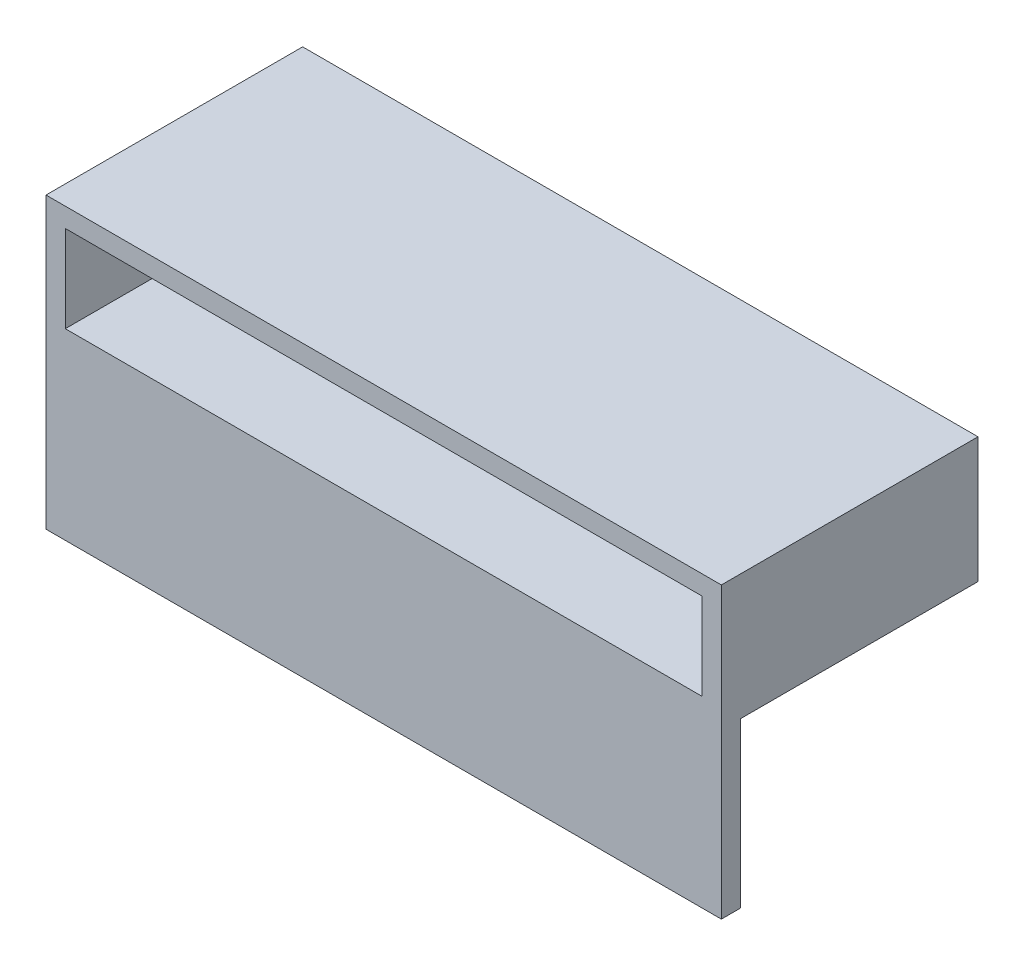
ISO-10303-21;
HEADER;
FILE_DESCRIPTION(('STEP AP214'),'2;1');
FILE_NAME('part.step','',(''),(''),'','','');
FILE_SCHEMA(('AUTOMOTIVE_DESIGN { 1 0 10303 214 1 1 1 1 }'));
ENDSEC;
DATA;
#1=APPLICATION_CONTEXT('core data for automotive mechanical design processes');
#2=APPLICATION_PROTOCOL_DEFINITION('international standard','automotive_design',2000,#1);
#3=PRODUCT_CONTEXT('',#1,'mechanical');
#4=PRODUCT('Part','Part','',(#3));
#5=PRODUCT_RELATED_PRODUCT_CATEGORY('part','',(#4));
#6=PRODUCT_DEFINITION_FORMATION('','',#4);
#7=PRODUCT_DEFINITION_CONTEXT('part definition',#1,'design');
#8=PRODUCT_DEFINITION('design','',#6,#7);
#9=PRODUCT_DEFINITION_SHAPE('','',#8);
#10=(LENGTH_UNIT() NAMED_UNIT(*) SI_UNIT(.MILLI.,.METRE.));
#11=(NAMED_UNIT(*) PLANE_ANGLE_UNIT() SI_UNIT($,.RADIAN.));
#12=(NAMED_UNIT(*) SI_UNIT($,.STERADIAN.) SOLID_ANGLE_UNIT());
#13=UNCERTAINTY_MEASURE_WITH_UNIT(LENGTH_MEASURE(1.E-05),#10,'distance_accuracy_value','');
#14=(GEOMETRIC_REPRESENTATION_CONTEXT(3) GLOBAL_UNCERTAINTY_ASSIGNED_CONTEXT((#13)) GLOBAL_UNIT_ASSIGNED_CONTEXT((#10,
#11,#12)) REPRESENTATION_CONTEXT('',''));
#15=CARTESIAN_POINT('',(0.,0.,0.));
#16=DIRECTION('',(0.,0.,1.));
#17=DIRECTION('',(1.,0.,0.));
#18=AXIS2_PLACEMENT_3D('',#15,#16,#17);
#19=CARTESIAN_POINT('',(-35.,0.,2.));
#20=DIRECTION('',(1.,0.,0.));
#21=DIRECTION('',(0.,0.,-1.));
#22=AXIS2_PLACEMENT_3D('',#19,#20,#21);
#23=PLANE('',#22);
#24=DIRECTION('',(0.,0.,-1.));
#25=VECTOR('',#24,1.);
#26=CARTESIAN_POINT('',(-35.,30.,2.));
#27=LINE('',#26,#25);
#28=CARTESIAN_POINT('',(-35.,30.,2.));
#29=VERTEX_POINT('',#28);
#30=CARTESIAN_POINT('',(-35.,30.,-24.6));
#31=VERTEX_POINT('',#30);
#32=EDGE_CURVE('E181',#29,#31,#27,.T.);
#33=ORIENTED_EDGE('',*,*,#32,.T.);
#34=DIRECTION('',(0.,1.,0.));
#35=VECTOR('',#34,1.);
#36=CARTESIAN_POINT('',(-35.,30.,-24.6));
#37=LINE('',#36,#35);
#38=CARTESIAN_POINT('',(-35.,17.,-24.6));
#39=VERTEX_POINT('',#38);
#40=EDGE_CURVE('E155',#39,#31,#37,.T.);
#41=ORIENTED_EDGE('',*,*,#40,.F.);
#42=DIRECTION('',(0.,0.,1.));
#43=VECTOR('',#42,1.);
#44=CARTESIAN_POINT('',(-35.,17.,-24.6));
#45=LINE('',#44,#43);
#46=CARTESIAN_POINT('',(-35.,17.,0.));
#47=VERTEX_POINT('',#46);
#48=EDGE_CURVE('E161',#39,#47,#45,.T.);
#49=ORIENTED_EDGE('',*,*,#48,.T.);
#50=DIRECTION('',(0.,-1.,0.));
#51=VECTOR('',#50,1.);
#52=CARTESIAN_POINT('',(-35.,0.,0.));
#53=LINE('',#52,#51);
#54=CARTESIAN_POINT('',(-35.,0.,0.));
#55=VERTEX_POINT('',#54);
#56=EDGE_CURVE('E169',#47,#55,#53,.T.);
#57=ORIENTED_EDGE('',*,*,#56,.T.);
#58=DIRECTION('',(0.,0.,-1.));
#59=VECTOR('',#58,1.);
#60=CARTESIAN_POINT('',(-35.,0.,2.));
#61=LINE('',#60,#59);
#62=CARTESIAN_POINT('',(-35.,0.,2.));
#63=VERTEX_POINT('',#62);
#64=EDGE_CURVE('E11',#63,#55,#61,.T.);
#65=ORIENTED_EDGE('',*,*,#64,.F.);
#66=DIRECTION('',(0.,-1.,0.));
#67=VECTOR('',#66,1.);
#68=CARTESIAN_POINT('',(-35.,0.,2.));
#69=LINE('',#68,#67);
#70=EDGE_CURVE('E170',#29,#63,#69,.T.);
#71=ORIENTED_EDGE('',*,*,#70,.F.);
#72=EDGE_LOOP('',(#33,#41,#49,#57,#65,#71));
#73=FACE_BOUND('',#72,.T.);
#74=ADVANCED_FACE('F35',(#73),#23,.F.);
#75=CARTESIAN_POINT('',(-35.,0.,2.));
#76=DIRECTION('',(0.,1.,0.));
#77=DIRECTION('',(0.,0.,1.));
#78=AXIS2_PLACEMENT_3D('',#75,#76,#77);
#79=PLANE('',#78);
#80=DIRECTION('',(1.,0.,0.));
#81=VECTOR('',#80,1.);
#82=CARTESIAN_POINT('',(-35.,0.,0.));
#83=LINE('',#82,#81);
#84=CARTESIAN_POINT('',(35.,0.,0.));
#85=VERTEX_POINT('',#84);
#86=EDGE_CURVE('E183',#55,#85,#83,.T.);
#87=ORIENTED_EDGE('',*,*,#86,.T.);
#88=DIRECTION('',(0.,0.,-1.));
#89=VECTOR('',#88,1.);
#90=CARTESIAN_POINT('',(35.,0.,2.));
#91=LINE('',#90,#89);
#92=CARTESIAN_POINT('',(35.,0.,2.));
#93=VERTEX_POINT('',#92);
#94=EDGE_CURVE('E42',#93,#85,#91,.T.);
#95=ORIENTED_EDGE('',*,*,#94,.F.);
#96=DIRECTION('',(1.,0.,0.));
#97=VECTOR('',#96,1.);
#98=CARTESIAN_POINT('',(-35.,0.,2.));
#99=LINE('',#98,#97);
#100=EDGE_CURVE('E173',#63,#93,#99,.T.);
#101=ORIENTED_EDGE('',*,*,#100,.F.);
#102=ORIENTED_EDGE('',*,*,#64,.T.);
#103=EDGE_LOOP('',(#87,#95,#101,#102));
#104=FACE_BOUND('',#103,.T.);
#105=ADVANCED_FACE('F199',(#104),#79,.F.);
#106=CARTESIAN_POINT('',(35.,0.,2.));
#107=DIRECTION('',(-1.,0.,0.));
#108=DIRECTION('',(0.,0.,1.));
#109=AXIS2_PLACEMENT_3D('',#106,#107,#108);
#110=PLANE('',#109);
#111=DIRECTION('',(0.,1.,0.));
#112=VECTOR('',#111,1.);
#113=CARTESIAN_POINT('',(35.,0.,0.));
#114=LINE('',#113,#112);
#115=CARTESIAN_POINT('',(35.,17.,0.));
#116=VERTEX_POINT('',#115);
#117=EDGE_CURVE('E174',#85,#116,#114,.T.);
#118=ORIENTED_EDGE('',*,*,#117,.T.);
#119=DIRECTION('',(0.,0.,1.));
#120=VECTOR('',#119,1.);
#121=CARTESIAN_POINT('',(35.,17.,-24.6));
#122=LINE('',#121,#120);
#123=CARTESIAN_POINT('',(35.,17.,-24.6));
#124=VERTEX_POINT('',#123);
#125=EDGE_CURVE('E166',#124,#116,#122,.T.);
#126=ORIENTED_EDGE('',*,*,#125,.F.);
#127=DIRECTION('',(0.,-1.,0.));
#128=VECTOR('',#127,1.);
#129=CARTESIAN_POINT('',(35.,30.,-24.6));
#130=LINE('',#129,#128);
#131=CARTESIAN_POINT('',(35.,30.,-24.6));
#132=VERTEX_POINT('',#131);
#133=EDGE_CURVE('E150',#132,#124,#130,.T.);
#134=ORIENTED_EDGE('',*,*,#133,.F.);
#135=DIRECTION('',(0.,0.,-1.));
#136=VECTOR('',#135,1.);
#137=CARTESIAN_POINT('',(35.,30.,2.));
#138=LINE('',#137,#136);
#139=CARTESIAN_POINT('',(35.,30.,2.));
#140=VERTEX_POINT('',#139);
#141=EDGE_CURVE('E187',#140,#132,#138,.T.);
#142=ORIENTED_EDGE('',*,*,#141,.F.);
#143=DIRECTION('',(0.,1.,0.));
#144=VECTOR('',#143,1.);
#145=CARTESIAN_POINT('',(35.,0.,2.));
#146=LINE('',#145,#144);
#147=EDGE_CURVE('E177',#93,#140,#146,.T.);
#148=ORIENTED_EDGE('',*,*,#147,.F.);
#149=ORIENTED_EDGE('',*,*,#94,.T.);
#150=EDGE_LOOP('',(#118,#126,#134,#142,#148,#149));
#151=FACE_BOUND('',#150,.T.);
#152=ADVANCED_FACE('F192',(#151),#110,.F.);
#153=CARTESIAN_POINT('',(-35.,30.,2.));
#154=DIRECTION('',(0.,-1.,0.));
#155=DIRECTION('',(0.,0.,-1.));
#156=AXIS2_PLACEMENT_3D('',#153,#154,#155);
#157=PLANE('',#156);
#158=ORIENTED_EDGE('',*,*,#141,.T.);
#159=DIRECTION('',(1.,0.,0.));
#160=VECTOR('',#159,1.);
#161=CARTESIAN_POINT('',(35.,30.,-24.6));
#162=LINE('',#161,#160);
#163=EDGE_CURVE('E158',#31,#132,#162,.T.);
#164=ORIENTED_EDGE('',*,*,#163,.F.);
#165=ORIENTED_EDGE('',*,*,#32,.F.);
#166=DIRECTION('',(-1.,0.,0.));
#167=VECTOR('',#166,1.);
#168=CARTESIAN_POINT('',(-35.,30.,2.));
#169=LINE('',#168,#167);
#170=EDGE_CURVE('E179',#140,#29,#169,.T.);
#171=ORIENTED_EDGE('',*,*,#170,.F.);
#172=EDGE_LOOP('',(#158,#164,#165,#171));
#173=FACE_BOUND('',#172,.T.);
#174=ADVANCED_FACE('F213',(#173),#157,.F.);
#175=CARTESIAN_POINT('',(-35.,30.,2.));
#176=DIRECTION('',(0.,0.,-1.));
#177=DIRECTION('',(-1.,0.,0.));
#178=AXIS2_PLACEMENT_3D('',#175,#176,#177);
#179=PLANE('',#178);
#180=DIRECTION('',(1.,0.,0.));
#181=VECTOR('',#180,1.);
#182=CARTESIAN_POINT('',(-33.,19.,2.));
#183=LINE('',#182,#181);
#184=CARTESIAN_POINT('',(-33.,19.,2.));
#185=VERTEX_POINT('',#184);
#186=CARTESIAN_POINT('',(33.,19.,2.));
#187=VERTEX_POINT('',#186);
#188=EDGE_CURVE('E141',#185,#187,#183,.T.);
#189=ORIENTED_EDGE('',*,*,#188,.F.);
#190=DIRECTION('',(0.,-1.,0.));
#191=VECTOR('',#190,1.);
#192=CARTESIAN_POINT('',(-33.,19.,2.));
#193=LINE('',#192,#191);
#194=CARTESIAN_POINT('',(-33.,28.,2.));
#195=VERTEX_POINT('',#194);
#196=EDGE_CURVE('E49',#195,#185,#193,.T.);
#197=ORIENTED_EDGE('',*,*,#196,.F.);
#198=DIRECTION('',(-1.,0.,0.));
#199=VECTOR('',#198,1.);
#200=CARTESIAN_POINT('',(-33.,28.,2.));
#201=LINE('',#200,#199);
#202=CARTESIAN_POINT('',(33.,28.,2.));
#203=VERTEX_POINT('',#202);
#204=EDGE_CURVE('E132',#203,#195,#201,.T.);
#205=ORIENTED_EDGE('',*,*,#204,.F.);
#206=DIRECTION('',(0.,1.,0.));
#207=VECTOR('',#206,1.);
#208=CARTESIAN_POINT('',(33.,19.,2.));
#209=LINE('',#208,#207);
#210=EDGE_CURVE('E135',#187,#203,#209,.T.);
#211=ORIENTED_EDGE('',*,*,#210,.F.);
#212=EDGE_LOOP('',(#189,#197,#205,#211));
#213=FACE_BOUND('',#212,.T.);
#214=ORIENTED_EDGE('',*,*,#70,.T.);
#215=ORIENTED_EDGE('',*,*,#100,.T.);
#216=ORIENTED_EDGE('',*,*,#147,.T.);
#217=ORIENTED_EDGE('',*,*,#170,.T.);
#218=EDGE_LOOP('',(#214,#215,#216,#217));
#219=FACE_BOUND('',#218,.T.);
#220=ADVANCED_FACE('F215',(#213,#219),#179,.F.);
#221=CARTESIAN_POINT('',(-35.,30.,0.));
#222=DIRECTION('',(0.,0.,-1.));
#223=DIRECTION('',(-1.,0.,0.));
#224=AXIS2_PLACEMENT_3D('',#221,#222,#223);
#225=PLANE('',#224);
#226=DIRECTION('',(-1.,0.,0.));
#227=VECTOR('',#226,1.);
#228=CARTESIAN_POINT('',(35.,17.,0.));
#229=LINE('',#228,#227);
#230=EDGE_CURVE('E57',#116,#47,#229,.T.);
#231=ORIENTED_EDGE('',*,*,#230,.F.);
#232=ORIENTED_EDGE('',*,*,#117,.F.);
#233=ORIENTED_EDGE('',*,*,#86,.F.);
#234=ORIENTED_EDGE('',*,*,#56,.F.);
#235=EDGE_LOOP('',(#231,#232,#233,#234));
#236=FACE_BOUND('',#235,.T.);
#237=ADVANCED_FACE('F197',(#236),#225,.T.);
#238=CARTESIAN_POINT('',(35.,17.,-24.6));
#239=DIRECTION('',(0.,1.,0.));
#240=DIRECTION('',(0.,0.,1.));
#241=AXIS2_PLACEMENT_3D('',#238,#239,#240);
#242=PLANE('',#241);
#243=ORIENTED_EDGE('',*,*,#230,.T.);
#244=ORIENTED_EDGE('',*,*,#48,.F.);
#245=DIRECTION('',(-1.,0.,0.));
#246=VECTOR('',#245,1.);
#247=CARTESIAN_POINT('',(35.,17.,-24.6));
#248=LINE('',#247,#246);
#249=EDGE_CURVE('E153',#124,#39,#248,.T.);
#250=ORIENTED_EDGE('',*,*,#249,.F.);
#251=ORIENTED_EDGE('',*,*,#125,.T.);
#252=EDGE_LOOP('',(#243,#244,#250,#251));
#253=FACE_BOUND('',#252,.T.);
#254=ADVANCED_FACE('F205',(#253),#242,.F.);
#255=CARTESIAN_POINT('',(35.,17.,-24.6));
#256=DIRECTION('',(0.,0.,-1.));
#257=DIRECTION('',(-1.,0.,0.));
#258=AXIS2_PLACEMENT_3D('',#255,#256,#257);
#259=PLANE('',#258);
#260=ORIENTED_EDGE('',*,*,#133,.T.);
#261=ORIENTED_EDGE('',*,*,#249,.T.);
#262=ORIENTED_EDGE('',*,*,#40,.T.);
#263=ORIENTED_EDGE('',*,*,#163,.T.);
#264=EDGE_LOOP('',(#260,#261,#262,#263));
#265=FACE_BOUND('',#264,.T.);
#266=ADVANCED_FACE('F209',(#265),#259,.T.);
#267=CARTESIAN_POINT('',(-33.,19.,-22.6));
#268=DIRECTION('',(-1.,0.,0.));
#269=DIRECTION('',(0.,0.,1.));
#270=AXIS2_PLACEMENT_3D('',#267,#268,#269);
#271=PLANE('',#270);
#272=ORIENTED_EDGE('',*,*,#196,.T.);
#273=DIRECTION('',(0.,0.,1.));
#274=VECTOR('',#273,1.);
#275=CARTESIAN_POINT('',(-33.,19.,-22.6));
#276=LINE('',#275,#274);
#277=CARTESIAN_POINT('',(-33.,19.,-22.6));
#278=VERTEX_POINT('',#277);
#279=EDGE_CURVE('E110',#278,#185,#276,.T.);
#280=ORIENTED_EDGE('',*,*,#279,.F.);
#281=DIRECTION('',(0.,-1.,0.));
#282=VECTOR('',#281,1.);
#283=CARTESIAN_POINT('',(-33.,19.,-22.6));
#284=LINE('',#283,#282);
#285=CARTESIAN_POINT('',(-33.,28.,-22.6));
#286=VERTEX_POINT('',#285);
#287=EDGE_CURVE('E114',#286,#278,#284,.T.);
#288=ORIENTED_EDGE('',*,*,#287,.F.);
#289=DIRECTION('',(0.,0.,1.));
#290=VECTOR('',#289,1.);
#291=CARTESIAN_POINT('',(-33.,28.,-22.6));
#292=LINE('',#291,#290);
#293=EDGE_CURVE('E145',#286,#195,#292,.T.);
#294=ORIENTED_EDGE('',*,*,#293,.T.);
#295=EDGE_LOOP('',(#272,#280,#288,#294));
#296=FACE_BOUND('',#295,.T.);
#297=ADVANCED_FACE('F112',(#296),#271,.F.);
#298=CARTESIAN_POINT('',(-33.,28.,-22.6));
#299=DIRECTION('',(0.,1.,0.));
#300=DIRECTION('',(0.,0.,1.));
#301=AXIS2_PLACEMENT_3D('',#298,#299,#300);
#302=PLANE('',#301);
#303=ORIENTED_EDGE('',*,*,#204,.T.);
#304=ORIENTED_EDGE('',*,*,#293,.F.);
#305=DIRECTION('',(-1.,0.,0.));
#306=VECTOR('',#305,1.);
#307=CARTESIAN_POINT('',(-33.,28.,-22.6));
#308=LINE('',#307,#306);
#309=CARTESIAN_POINT('',(33.,28.,-22.6));
#310=VERTEX_POINT('',#309);
#311=EDGE_CURVE('E120',#310,#286,#308,.T.);
#312=ORIENTED_EDGE('',*,*,#311,.F.);
#313=DIRECTION('',(0.,0.,1.));
#314=VECTOR('',#313,1.);
#315=CARTESIAN_POINT('',(33.,28.,-22.6));
#316=LINE('',#315,#314);
#317=EDGE_CURVE('E147',#310,#203,#316,.T.);
#318=ORIENTED_EDGE('',*,*,#317,.T.);
#319=EDGE_LOOP('',(#303,#304,#312,#318));
#320=FACE_BOUND('',#319,.T.);
#321=ADVANCED_FACE('F280',(#320),#302,.F.);
#322=CARTESIAN_POINT('',(33.,19.,-22.6));
#323=DIRECTION('',(1.,0.,0.));
#324=DIRECTION('',(0.,0.,-1.));
#325=AXIS2_PLACEMENT_3D('',#322,#323,#324);
#326=PLANE('',#325);
#327=ORIENTED_EDGE('',*,*,#210,.T.);
#328=ORIENTED_EDGE('',*,*,#317,.F.);
#329=DIRECTION('',(0.,1.,0.));
#330=VECTOR('',#329,1.);
#331=CARTESIAN_POINT('',(33.,19.,-22.6));
#332=LINE('',#331,#330);
#333=CARTESIAN_POINT('',(33.,19.,-22.6));
#334=VERTEX_POINT('',#333);
#335=EDGE_CURVE('E128',#334,#310,#332,.T.);
#336=ORIENTED_EDGE('',*,*,#335,.F.);
#337=DIRECTION('',(0.,0.,1.));
#338=VECTOR('',#337,1.);
#339=CARTESIAN_POINT('',(33.,19.,-22.6));
#340=LINE('',#339,#338);
#341=EDGE_CURVE('E119',#334,#187,#340,.T.);
#342=ORIENTED_EDGE('',*,*,#341,.T.);
#343=EDGE_LOOP('',(#327,#328,#336,#342));
#344=FACE_BOUND('',#343,.T.);
#345=ADVANCED_FACE('F253',(#344),#326,.F.);
#346=CARTESIAN_POINT('',(-33.,19.,-22.6));
#347=DIRECTION('',(0.,-1.,0.));
#348=DIRECTION('',(0.,0.,-1.));
#349=AXIS2_PLACEMENT_3D('',#346,#347,#348);
#350=PLANE('',#349);
#351=ORIENTED_EDGE('',*,*,#188,.T.);
#352=ORIENTED_EDGE('',*,*,#341,.F.);
#353=DIRECTION('',(1.,0.,0.));
#354=VECTOR('',#353,1.);
#355=CARTESIAN_POINT('',(-33.,19.,-22.6));
#356=LINE('',#355,#354);
#357=EDGE_CURVE('E123',#278,#334,#356,.T.);
#358=ORIENTED_EDGE('',*,*,#357,.F.);
#359=ORIENTED_EDGE('',*,*,#279,.T.);
#360=EDGE_LOOP('',(#351,#352,#358,#359));
#361=FACE_BOUND('',#360,.T.);
#362=ADVANCED_FACE('F124',(#361),#350,.F.);
#363=CARTESIAN_POINT('',(-33.,28.,-22.6));
#364=DIRECTION('',(0.,0.,-1.));
#365=DIRECTION('',(-1.,0.,0.));
#366=AXIS2_PLACEMENT_3D('',#363,#364,#365);
#367=PLANE('',#366);
#368=ORIENTED_EDGE('',*,*,#287,.T.);
#369=ORIENTED_EDGE('',*,*,#357,.T.);
#370=ORIENTED_EDGE('',*,*,#335,.T.);
#371=ORIENTED_EDGE('',*,*,#311,.T.);
#372=EDGE_LOOP('',(#368,#369,#370,#371));
#373=FACE_BOUND('',#372,.T.);
#374=ADVANCED_FACE('F130',(#373),#367,.F.);
#375=CLOSED_SHELL('',(#74,#105,#152,#174,#220,#237,#254,#266,#297,#321,#345,#362,#374));
#376=MANIFOLD_SOLID_BREP('B2',#375);
#377=ADVANCED_BREP_SHAPE_REPRESENTATION('',(#18,#376),#14);
#378=SHAPE_DEFINITION_REPRESENTATION(#9,#377);
ENDSEC;
END-ISO-10303-21;
